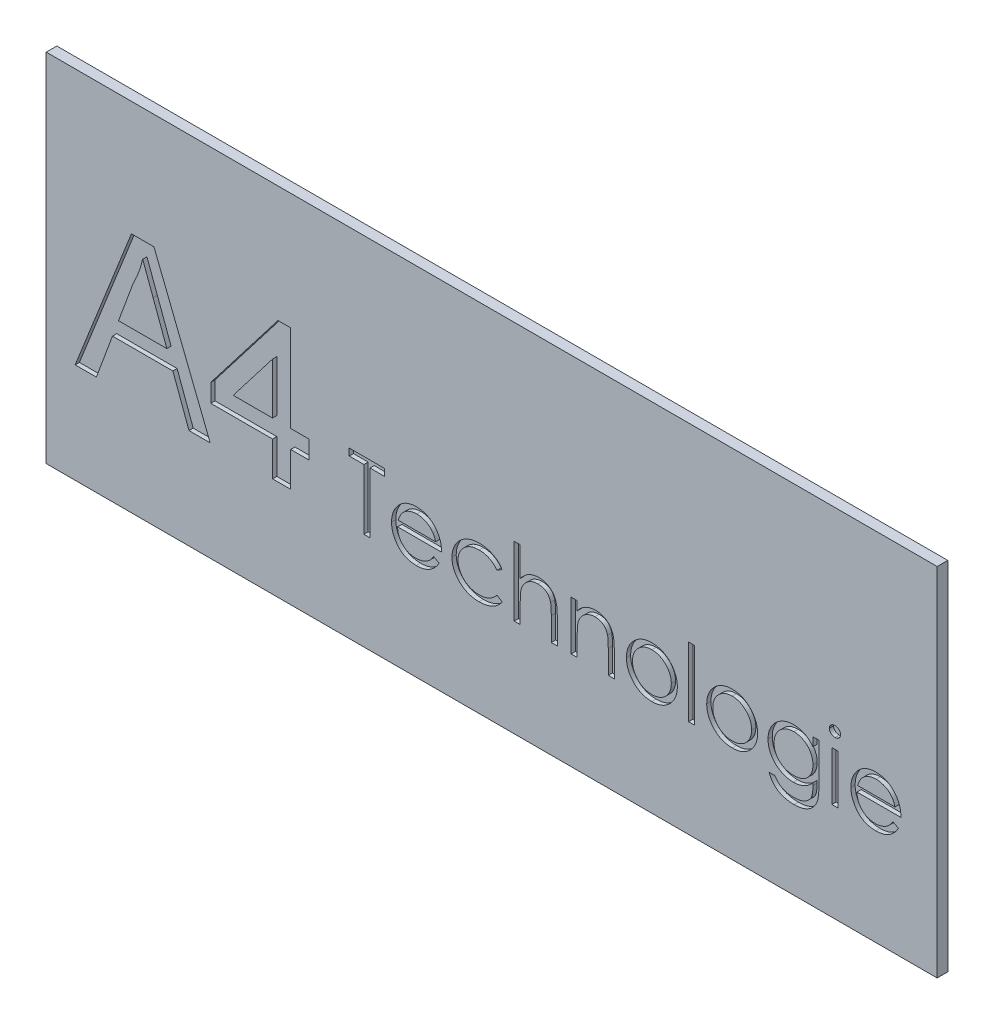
from build123d import *

# Parameters (mm, degrees)
ESQUISSE1_W             = 42
ESQUISSE1_H             = 16.8
EXTRUSION1_DEPTH        = 0.5
ENL_V_MAT_EXTRU_1_DEPTH = 0.2
ESQUISSE3_W             = 0.284935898
ESQUISSE3_H             = 3.256410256
ESQUISSE3_H_2           = 2.320192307
ENL_V_MAT_EXTRU_2_DEPTH = 0.2


with BuildPart() as part:
    # Esquisse1 → Extrusion1 (new body)
    with BuildSketch(Plane.XY):
        with Locations((21, 8.4)):
            Rectangle(ESQUISSE1_W, ESQUISSE1_H)
    extrude(amount=EXTRUSION1_DEPTH)

    # Esquisse2 → Enl_v. mat.-Extru.1 (cut)
    # profile 1 of 2: a face of its own
    with BuildSketch(Plane.XY.offset(0.5)):
        Polygon((1.364203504, 4.713201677), (4.01545748, 11.390830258), (5.077564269, 11.390830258), (7.728818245, 4.713201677), (6.729581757, 4.713201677), (5.969787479, 6.767856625), (3.12323427, 6.767856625), (2.363439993, 4.713201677), align=None)
        with BuildLine():
            Line((3.406819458, 7.538352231), (5.686202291, 7.538352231))
            Line((5.686202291, 7.538352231), (5.03743429, 9.293369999))
            add(Edge.make_bspline(
                [(5.03743429, 9.293369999), (5.012562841, 9.361181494), (4.963934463, 9.49376577), (4.891414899, 9.686399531), (4.825162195, 9.869332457), (4.760195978, 10.039941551), (4.701549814, 10.200705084), (4.647494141, 10.350537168), (4.594033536, 10.488396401), (4.561951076, 10.57746767), (4.546510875, 10.620334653)],
                knots=[0, 0, 0, 0, 1.225184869, 2.395467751, 3.491410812, 4.525364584, 5.492066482, 6.394148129, 7.227157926, 8, 8, 8, 8], degree=3))
            add(Edge.make_bspline(
                [(4.546510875, 10.620334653), (4.520969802, 10.514628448), (4.469782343, 10.30278018), (4.362608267, 9.992394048), (4.240004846, 9.684846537), (4.140436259, 9.48666502), (4.090366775, 9.387006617)],
                knots=[0, 0, 0, 0, 0.9891762, 1.982431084, 2.985436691, 4, 4, 4, 4], degree=3))
            Line((4.090366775, 9.387006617), (3.406819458, 7.538352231))
        make_face(mode=Mode.SUBTRACT)
    # profile 2 of 2: a face of its own
    with BuildSketch(Plane.XY.offset(0.5)):
        Polygon((10.667670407, 4.713201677), (10.667670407, 6.339803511), (7.756909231, 6.339803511), (7.756909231, 7.195909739), (10.924502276, 11.305219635), (11.523776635, 11.305219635), (11.523776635, 7.195909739), (12.379882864, 7.195909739), (12.379882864, 6.339803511), (11.523776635, 6.339803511), (11.523776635, 4.713201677), align=None)
        Polygon((10.667670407, 7.195909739), (10.667670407, 9.601033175), (8.813665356, 7.195909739), align=None, mode=Mode.SUBTRACT)
    extrude(amount=-ENL_V_MAT_EXTRU_1_DEPTH, mode=Mode.SUBTRACT)

    # Esquisse3 → Enl_v. mat.-Extru.2 (cut)
    # profile 1 of 12: a face of its own
    with BuildSketch(Plane.XY.offset(0.5)):
        Polygon((14.28392338, 7.45181383), (14.28392338, 7.777454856), (15.952833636, 7.777454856), (15.952833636, 7.45181383), (15.260846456, 7.45181383), (15.260846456, 4.602454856), (14.975910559, 4.602454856), (14.975910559, 7.45181383), align=None)
    # profile 2 of 12: a face of its own
    with BuildSketch(Plane.XY.offset(0.5)):
        with BuildLine():
            Line((18.264121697, 5.335147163), (18.517256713, 5.202219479))
            add(Edge.make_bspline(
                [(18.517256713, 5.202219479), (18.497084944, 5.166438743), (18.457838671, 5.0968236), (18.390346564, 5.00118184), (18.319596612, 4.915141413), (18.242395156, 4.84100094), (18.161051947, 4.776365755), (18.075115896, 4.719816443), (17.984139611, 4.671630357), (17.888118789, 4.631033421), (17.786247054, 4.599819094), (17.678277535, 4.577771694), (17.564003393, 4.564143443), (17.485675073, 4.562560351), (17.445567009, 4.561749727)],
                knots=[0, 0, 0, 0, 1.120438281, 2.179929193, 3.190490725, 4.156257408, 5.095198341, 6.022838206, 6.959905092, 7.901321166, 8.864066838, 9.862729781, 10.905609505, 12, 12, 12, 12], degree=3))
            add(Edge.make_bspline(
                [(17.445567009, 4.561749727), (17.400988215, 4.562790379), (17.314027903, 4.56482039), (17.187445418, 4.582321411), (17.068265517, 4.610871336), (16.956494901, 4.650754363), (16.852407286, 4.70284915), (16.755795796, 4.766312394), (16.666152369, 4.840818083), (16.586301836, 4.927011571), (16.514416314, 5.019251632), (16.450983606, 5.115368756), (16.397954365, 5.215121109), (16.354817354, 5.317873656), (16.319978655, 5.42297876), (16.295697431, 5.531392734), (16.281700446, 5.642822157), (16.279555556, 5.718203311), (16.278474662, 5.756190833)],
                knots=[0, 0, 0, 0, 1.145258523, 2.234067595, 3.276747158, 4.290159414, 5.277019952, 6.260822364, 7.254936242, 8.264827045, 9.274100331, 10.257902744, 11.220704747, 12.172965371, 13.118907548, 14.062713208, 15.023725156, 16, 16, 16, 16], degree=3))
            add(Edge.make_bspline(
                [(16.278474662, 5.756190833), (16.279435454, 5.791836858), (16.281339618, 5.862482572), (16.293341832, 5.967044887), (16.314612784, 6.068670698), (16.343801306, 6.167444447), (16.381494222, 6.263200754), (16.427606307, 6.355997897), (16.482209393, 6.445737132), (16.524366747, 6.502345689), (16.545602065, 6.530860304)],
                knots=[0, 0, 0, 0, 1.024358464, 2.0301432, 3.019427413, 4.004406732, 4.986367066, 5.972626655, 6.978780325, 8, 8, 8, 8], degree=3))
            add(Edge.make_bspline(
                [(16.545602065, 6.530860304), (16.574365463, 6.565212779), (16.630981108, 6.63282953), (16.726735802, 6.721673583), (16.830422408, 6.796099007), (16.940741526, 6.857791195), (17.058975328, 6.904666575), (17.18353447, 6.939598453), (17.315837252, 6.959172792), (17.406284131, 6.961937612), (17.452563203, 6.963352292)],
                knots=[0, 0, 0, 0, 1.030682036, 2.02871468, 2.997146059, 3.962720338, 4.930598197, 5.918074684, 6.934738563, 8, 8, 8, 8], degree=3))
            add(Edge.make_bspline(
                [(17.452563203, 6.963352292), (17.500140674, 6.962123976), (17.593476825, 6.9597143), (17.729577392, 6.937374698), (17.858356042, 6.901948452), (17.979761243, 6.851916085), (18.093805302, 6.787364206), (18.199746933, 6.707406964), (18.299397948, 6.614499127), (18.357372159, 6.543049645), (18.386873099, 6.506691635)],
                knots=[0, 0, 0, 0, 1.056321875, 2.072262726, 3.055038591, 4.01806755, 4.982017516, 5.957941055, 6.960871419, 8, 8, 8, 8], degree=3))
            add(Edge.make_bspline(
                [(18.386873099, 6.506691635), (18.406945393, 6.479292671), (18.446956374, 6.424677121), (18.497073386, 6.335621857), (18.540577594, 6.242448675), (18.575351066, 6.143651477), (18.603508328, 6.040400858), (18.623879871, 5.931958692), (18.635826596, 5.818357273), (18.638174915, 5.740953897), (18.639372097, 5.701493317)],
                knots=[0, 0, 0, 0, 0.94817472, 1.890038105, 2.849395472, 3.817997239, 4.812318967, 5.836947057, 6.897266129, 8, 8, 8, 8], degree=3))
            Line((18.639372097, 5.701493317), (16.563410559, 5.701493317))
            add(Edge.make_bspline(
                [(16.563410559, 5.701493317), (16.564807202, 5.670922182), (16.567553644, 5.610805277), (16.580358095, 5.522838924), (16.600540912, 5.439043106), (16.628906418, 5.360046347), (16.663257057, 5.284816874), (16.705335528, 5.21391274), (16.755536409, 5.147656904), (16.811530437, 5.085456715), (16.873857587, 5.030065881), (16.939428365, 4.980488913), (17.009181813, 4.938936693), (17.082567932, 4.905209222), (17.159468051, 4.878805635), (17.2399064, 4.860782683), (17.323724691, 4.848711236), (17.38086175, 4.847368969), (17.409950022, 4.846685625)],
                knots=[0, 0, 0, 0, 1.094153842, 2.151609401, 3.174256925, 4.172055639, 5.149267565, 6.128595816, 7.11444997, 8.118368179, 9.117203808, 10.09244225, 11.054858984, 12.015122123, 12.976791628, 13.957293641, 14.960065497, 16, 16, 16, 16], degree=3))
            add(Edge.make_bspline(
                [(17.409950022, 4.846685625), (17.438389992, 4.847237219), (17.494820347, 4.848331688), (17.578858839, 4.858974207), (17.66153541, 4.876182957), (17.742507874, 4.899668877), (17.820132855, 4.928313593), (17.89201989, 4.962878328), (17.958132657, 5.001114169), (18.019924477, 5.044847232), (18.079860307, 5.098376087), (18.139316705, 5.165174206), (18.203067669, 5.244175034), (18.242972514, 5.303634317), (18.264121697, 5.335147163)],
                knots=[0, 0, 0, 0, 0.99110716, 1.966546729, 2.947904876, 3.932708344, 4.903319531, 5.828989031, 6.710028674, 7.56322171, 8.463672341, 9.504779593, 10.677557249, 12, 12, 12, 12], degree=3))
        make_face()
        with BuildLine():
            add(Edge.make_bspline(
                [(18.3544362, 5.986429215), (18.344007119, 6.024223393), (18.323934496, 6.09696502), (18.281991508, 6.197694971), (18.234755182, 6.287218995), (18.178855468, 6.364851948), (18.11551991, 6.433797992), (18.042363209, 6.494049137), (17.960324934, 6.547949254), (17.869829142, 6.593444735), (17.773996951, 6.632170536), (17.673661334, 6.658137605), (17.571283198, 6.675926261), (17.502037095, 6.677582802), (17.467191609, 6.678416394)],
                knots=[0, 0, 0, 0, 1.154881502, 2.222775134, 3.210006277, 4.132804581, 5.035138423, 5.962687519, 6.919655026, 7.923214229, 8.944639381, 9.960483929, 10.97369054, 12, 12, 12, 12], degree=3))
            add(Edge.make_bspline(
                [(17.467191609, 6.678416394), (17.438753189, 6.677861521), (17.382536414, 6.676764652), (17.299713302, 6.666359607), (17.220175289, 6.649160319), (17.143335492, 6.625606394), (17.070200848, 6.594211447), (16.999267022, 6.557396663), (16.932337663, 6.512455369), (16.890480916, 6.478202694), (16.869335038, 6.460898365)],
                knots=[0, 0, 0, 0, 1.04873581, 2.073130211, 3.073294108, 4.04793562, 5.032784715, 6.005352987, 6.992311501, 8, 8, 8, 8], degree=3))
            add(Edge.make_bspline(
                [(16.869335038, 6.460898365), (16.854191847, 6.447205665), (16.823545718, 6.419494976), (16.782596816, 6.371752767), (16.743389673, 6.320270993), (16.707708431, 6.263080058), (16.674980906, 6.200831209), (16.644355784, 6.134049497), (16.616790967, 6.062228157), (16.601282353, 6.012178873), (16.593303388, 5.986429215)],
                knots=[0, 0, 0, 0, 0.879870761, 1.780643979, 2.707998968, 3.669668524, 4.684282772, 5.740141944, 6.837334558, 8, 8, 8, 8], degree=3))
            Line((16.593303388, 5.986429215), (18.3544362, 5.986429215))
        make_face(mode=Mode.SUBTRACT)
    # profile 3 of 12: a face of its own
    with BuildSketch(Plane.XY.offset(0.5)):
        with BuildLine():
            Line((21.488731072, 6.419557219), (21.250224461, 6.271365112))
            add(Edge.make_bspline(
                [(21.250224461, 6.271365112), (21.224071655, 6.303866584), (21.172594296, 6.367840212), (21.083205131, 6.450399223), (20.987944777, 6.521307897), (20.885185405, 6.579096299), (20.775071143, 6.623747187), (20.658036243, 6.655343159), (20.534097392, 6.675032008), (20.449129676, 6.677269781), (20.405593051, 6.678416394)],
                knots=[0, 0, 0, 0, 1.026593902, 2.0206758, 2.988051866, 3.946915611, 4.916868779, 5.907761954, 6.927957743, 8, 8, 8, 8], degree=3))
            add(Edge.make_bspline(
                [(20.405593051, 6.678416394), (20.370795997, 6.677457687), (20.302264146, 6.67556954), (20.201656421, 6.663767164), (20.105823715, 6.642320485), (20.014165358, 6.614062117), (19.927333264, 6.57618864), (19.845099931, 6.530096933), (19.76673595, 6.47653011), (19.694512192, 6.414471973), (19.628445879, 6.346981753), (19.571206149, 6.274633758), (19.521370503, 6.199594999), (19.482267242, 6.119991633), (19.450267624, 6.037644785), (19.429215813, 5.951000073), (19.415187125, 5.861167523), (19.413582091, 5.799918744), (19.412769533, 5.768911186)],
                knots=[0, 0, 0, 0, 1.112346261, 2.190735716, 3.231507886, 4.247384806, 5.251966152, 6.253067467, 7.256802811, 8.280671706, 9.291813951, 10.270744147, 11.225547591, 12.165006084, 13.100104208, 14.043489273, 15.009504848, 16, 16, 16, 16], degree=3))
            add(Edge.make_bspline(
                [(19.412769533, 5.768911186), (19.414383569, 5.728299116), (19.417589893, 5.647622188), (19.442719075, 5.528534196), (19.48385293, 5.413396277), (19.540148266, 5.303025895), (19.611338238, 5.200886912), (19.69495192, 5.109280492), (19.79103566, 5.029981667), (19.898742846, 4.964238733), (20.015544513, 4.91138735), (20.140176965, 4.873734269), (20.271621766, 4.851008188), (20.361616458, 4.848145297), (20.407501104, 4.846685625)],
                knots=[0, 0, 0, 0, 0.966302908, 1.919585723, 2.883856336, 3.870342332, 4.860282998, 5.839159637, 6.814385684, 7.815993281, 8.834850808, 9.858348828, 10.908058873, 12, 12, 12, 12], degree=3))
            add(Edge.make_bspline(
                [(20.407501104, 4.846685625), (20.449551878, 4.847864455), (20.532192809, 4.850181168), (20.65299456, 4.869711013), (20.768002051, 4.901682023), (20.877211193, 4.946265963), (20.980422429, 5.003894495), (21.076968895, 5.074977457), (21.168771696, 5.157469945), (21.222743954, 5.22125839), (21.250224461, 5.253736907)],
                knots=[0, 0, 0, 0, 1.039848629, 2.043578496, 3.018386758, 3.987534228, 4.954977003, 5.934852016, 6.948509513, 8, 8, 8, 8], degree=3))
            Line((21.250224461, 5.253736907), (21.488731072, 5.09727657))
            add(Edge.make_bspline(
                [(21.488731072, 5.09727657), (21.474590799, 5.076511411), (21.446357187, 5.035050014), (21.399160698, 4.976589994), (21.348251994, 4.921869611), (21.293829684, 4.870962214), (21.236604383, 4.822649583), (21.174621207, 4.779241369), (21.109878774, 4.738297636), (21.041617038, 4.70145596), (20.970541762, 4.668339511), (20.896752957, 4.639863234), (20.82057127, 4.615397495), (20.741907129, 4.595950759), (20.66060545, 4.580428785), (20.576876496, 4.570129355), (20.490749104, 4.562441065), (20.432535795, 4.561982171), (20.40304898, 4.561749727)],
                knots=[0, 0, 0, 0, 0.954134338, 1.905101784, 2.851144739, 3.791306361, 4.734911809, 5.6936923, 6.663572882, 7.643865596, 8.638447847, 9.640600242, 10.646758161, 11.676244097, 12.717260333, 13.78922464, 14.880174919, 16, 16, 16, 16], degree=3))
            add(Edge.make_bspline(
                [(20.40304898, 4.561749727), (20.358044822, 4.562558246), (20.269836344, 4.564142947), (20.140729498, 4.581567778), (20.017345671, 4.607836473), (19.899727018, 4.645540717), (19.787855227, 4.694077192), (19.681834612, 4.75336525), (19.582016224, 4.823897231), (19.489387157, 4.904417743), (19.404313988, 4.991721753), (19.33126523, 5.085928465), (19.267905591, 5.183574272), (19.217026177, 5.286815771), (19.176525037, 5.394280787), (19.148852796, 5.506830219), (19.130955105, 5.623536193), (19.128883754, 5.70312245), (19.127833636, 5.743470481)],
                knots=[0, 0, 0, 0, 1.1129367, 2.181364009, 3.217532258, 4.231199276, 5.232079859, 6.230262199, 7.231623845, 8.250719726, 9.263571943, 10.242672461, 11.195837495, 12.138959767, 13.085126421, 14.0317438, 15.002148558, 16, 16, 16, 16], degree=3))
            add(Edge.make_bspline(
                [(19.127833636, 5.743470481), (19.128233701, 5.770846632), (19.129029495, 5.825302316), (19.138157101, 5.906124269), (19.149948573, 5.985869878), (19.169929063, 6.063528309), (19.19300735, 6.140277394), (19.222467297, 6.215192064), (19.257025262, 6.288620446), (19.296260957, 6.360373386), (19.340428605, 6.429270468), (19.389306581, 6.494361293), (19.441053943, 6.556427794), (19.498091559, 6.613327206), (19.557998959, 6.667335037), (19.622471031, 6.717008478), (19.691137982, 6.76249352), (19.762968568, 6.804631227), (19.837920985, 6.842150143), (19.915542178, 6.87447458), (19.995364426, 6.902099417), (20.077515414, 6.92396965), (20.161449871, 6.942309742), (20.247829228, 6.953846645), (20.33632303, 6.961998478), (20.396245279, 6.962897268), (20.426581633, 6.963352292)],
                knots=[0, 0, 0, 0, 0.990994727, 1.971252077, 2.943264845, 3.907940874, 4.872158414, 5.844625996, 6.82015047, 7.809835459, 8.804511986, 9.781214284, 10.756496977, 11.728388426, 12.696359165, 13.676225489, 14.672885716, 15.677705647, 16.690706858, 17.706033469, 18.721040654, 19.747369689, 20.783475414, 21.830280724, 22.901553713, 24, 24, 24, 24], degree=3))
            add(Edge.make_bspline(
                [(20.426581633, 6.963352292), (20.464572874, 6.962516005), (20.540365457, 6.960847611), (20.652797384, 6.946806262), (20.76357331, 6.925636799), (20.870749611, 6.894274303), (20.973026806, 6.856297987), (21.068762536, 6.813650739), (21.155703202, 6.764125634), (21.235466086, 6.709950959), (21.308200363, 6.648844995), (21.374652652, 6.580077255), (21.436185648, 6.504005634), (21.471071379, 6.447939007), (21.488731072, 6.419557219)],
                knots=[0, 0, 0, 0, 1.095225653, 2.184976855, 3.262915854, 4.344593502, 5.400796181, 6.407717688, 7.363229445, 8.282371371, 9.184954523, 10.097238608, 11.036792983, 12, 12, 12, 12], degree=3))
        make_face()
    # profile 4 of 12: a face of its own
    with BuildSketch(Plane.XY.offset(0.5)):
        with BuildLine():
            Line((22.058602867, 7.858865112), (22.343538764, 7.858865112))
            Line((22.343538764, 7.858865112), (22.343538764, 6.484431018))
            add(Edge.make_bspline(
                [(22.343538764, 6.484431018), (22.374125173, 6.52266163), (22.43367848, 6.597098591), (22.533914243, 6.694218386), (22.636848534, 6.778399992), (22.746036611, 6.84541105), (22.859475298, 6.898348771), (22.977643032, 6.935893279), (23.10056177, 6.958981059), (23.184041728, 6.961882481), (23.226331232, 6.963352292)],
                knots=[0, 0, 0, 0, 1.125788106, 2.19196713, 3.20547328, 4.180437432, 5.132270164, 6.079753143, 7.027236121, 8, 8, 8, 8], degree=3))
            add(Edge.make_bspline(
                [(23.226331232, 6.963352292), (23.26926666, 6.961768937), (23.353301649, 6.95866993), (23.475658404, 6.934164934), (23.589922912, 6.892293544), (23.695755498, 6.834992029), (23.790846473, 6.763624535), (23.875074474, 6.681227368), (23.943872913, 6.585728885), (23.990680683, 6.497503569), (24.02113656, 6.419000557), (24.040415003, 6.351657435), (24.05676099, 6.276616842), (24.071002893, 6.193917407), (24.080494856, 6.103162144), (24.088119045, 6.004760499), (24.093540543, 5.898718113), (24.093750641, 5.825311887), (24.093859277, 5.787355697)],
                knots=[0, 0, 0, 0, 1.235656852, 2.418478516, 3.575258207, 4.727955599, 5.870717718, 6.98870536, 8.107142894, 9.245821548, 9.854588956, 10.528768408, 11.260415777, 12.065282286, 12.943670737, 13.886611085, 14.907229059, 16, 16, 16, 16], degree=3))
            Line((24.093859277, 5.787355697), (24.093859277, 4.602454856))
            Line((24.093859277, 4.602454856), (23.80892338, 4.602454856))
            Line((23.80892338, 4.602454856), (23.80892338, 5.693861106))
            add(Edge.make_bspline(
                [(23.80892338, 5.693861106), (23.808750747, 5.725450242), (23.808420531, 5.785874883), (23.807328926, 5.872385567), (23.804892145, 5.950849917), (23.800954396, 6.021016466), (23.79681301, 6.082983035), (23.791113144, 6.136659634), (23.784481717, 6.182119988), (23.778522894, 6.209483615), (23.775850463, 6.221755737)],
                knots=[0, 0, 0, 0, 1.430932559, 2.737130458, 3.918967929, 4.986496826, 5.920444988, 6.731744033, 7.431208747, 8, 8, 8, 8], degree=3))
            add(Edge.make_bspline(
                [(23.775850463, 6.221755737), (23.765487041, 6.257764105), (23.745563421, 6.326989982), (23.699255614, 6.421026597), (23.641417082, 6.501204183), (23.570798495, 6.566440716), (23.488649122, 6.617614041), (23.394433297, 6.653054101), (23.289037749, 6.675050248), (23.214786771, 6.677263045), (23.176085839, 6.678416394)],
                knots=[0, 0, 0, 0, 1.090059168, 2.095632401, 3.037101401, 3.955032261, 4.878929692, 5.839099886, 6.873700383, 8, 8, 8, 8], degree=3))
            add(Edge.make_bspline(
                [(23.176085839, 6.678416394), (23.15316436, 6.677984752), (23.107803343, 6.677130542), (23.04053991, 6.668554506), (22.975289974, 6.654540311), (22.911425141, 6.635576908), (22.850298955, 6.609772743), (22.790129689, 6.579900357), (22.732622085, 6.543335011), (22.676754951, 6.502308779), (22.62475976, 6.456888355), (22.576384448, 6.408948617), (22.533260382, 6.357899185), (22.494191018, 6.30455908), (22.460465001, 6.248196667), (22.43102542, 6.189355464), (22.40604661, 6.127958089), (22.393634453, 6.085344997), (22.38742398, 6.064023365)],
                knots=[0, 0, 0, 0, 1.024319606, 2.027102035, 3.025350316, 4.005802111, 5.00026367, 5.987881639, 7.005602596, 8.042517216, 9.083927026, 10.089214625, 11.084353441, 12.06828073, 13.041928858, 14.016821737, 15.00770877, 16, 16, 16, 16], degree=3))
            add(Edge.make_bspline(
                [(22.38742398, 6.064023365), (22.383850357, 6.048582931), (22.376062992, 6.014936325), (22.367613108, 5.959442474), (22.360049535, 5.894956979), (22.353655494, 5.821577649), (22.349733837, 5.739035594), (22.345508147, 5.647894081), (22.343935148, 5.547582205), (22.343674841, 5.477826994), (22.343538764, 5.441362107)],
                knots=[0, 0, 0, 0, 0.607992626, 1.324890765, 2.152360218, 3.099583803, 4.150613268, 5.323148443, 6.60066238, 8, 8, 8, 8], degree=3))
            Line((22.343538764, 5.441362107), (22.343538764, 4.602454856))
            Line((22.343538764, 4.602454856), (22.058602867, 4.602454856))
            Line((22.058602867, 4.602454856), (22.058602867, 7.858865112))
        make_face()
    # profile 5 of 12: a face of its own
    with BuildSketch(Plane.XY.offset(0.5)):
        with BuildLine():
            Line((24.745141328, 6.922647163), (25.030077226, 6.922647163))
            Line((25.030077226, 6.922647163), (25.030077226, 6.504147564))
            add(Edge.make_bspline(
                [(25.030077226, 6.504147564), (25.060500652, 6.542104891), (25.119538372, 6.615762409), (25.217858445, 6.712573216), (25.321766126, 6.792352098), (25.430625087, 6.855946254), (25.544583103, 6.903885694), (25.662945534, 6.938507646), (25.786421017, 6.959267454), (25.870390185, 6.96198002), (25.912869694, 6.963352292)],
                knots=[0, 0, 0, 0, 1.12780773, 2.188550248, 3.19190651, 4.159438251, 5.104880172, 6.052711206, 7.014878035, 8, 8, 8, 8], degree=3))
            add(Edge.make_bspline(
                [(25.912869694, 6.963352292), (25.95580534, 6.96176915), (26.039840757, 6.95867056), (26.162194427, 6.934162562), (26.276470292, 6.892302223), (26.382260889, 6.834959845), (26.477626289, 6.763652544), (26.561378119, 6.680578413), (26.630650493, 6.585023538), (26.677093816, 6.496374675), (26.707687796, 6.417735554), (26.726948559, 6.350383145), (26.743305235, 6.275345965), (26.757485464, 6.192850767), (26.767080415, 6.102319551), (26.774648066, 6.004123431), (26.780071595, 5.898294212), (26.780286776, 5.825099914), (26.780397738, 5.787355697)],
                knots=[0, 0, 0, 0, 1.235846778, 2.418850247, 3.575807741, 4.728682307, 5.871620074, 6.994088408, 8.11269785, 9.256955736, 9.865816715, 10.540099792, 11.271859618, 12.076849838, 12.949306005, 13.892391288, 14.913166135, 16, 16, 16, 16], degree=3))
            Line((26.780397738, 5.787355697), (26.780397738, 4.602454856))
            Line((26.780397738, 4.602454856), (26.495461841, 4.602454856))
            Line((26.495461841, 4.602454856), (26.495461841, 5.693861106))
            add(Edge.make_bspline(
                [(26.495461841, 5.693861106), (26.495286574, 5.725450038), (26.494951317, 5.785874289), (26.493893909, 5.872387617), (26.491345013, 5.950843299), (26.487763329, 6.021053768), (26.482520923, 6.082951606), (26.477057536, 6.136662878), (26.47037645, 6.182119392), (26.46442295, 6.209483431), (26.461752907, 6.221755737)],
                knots=[0, 0, 0, 0, 1.430800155, 2.736877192, 3.918605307, 4.986035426, 5.920637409, 6.731861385, 7.431261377, 8, 8, 8, 8], degree=3))
            add(Edge.make_bspline(
                [(26.461752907, 6.221755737), (26.452114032, 6.257779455), (26.43356218, 6.327113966), (26.387720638, 6.421161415), (26.329832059, 6.501169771), (26.259167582, 6.566644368), (26.176409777, 6.617599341), (26.081788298, 6.652954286), (25.976216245, 6.675067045), (25.901962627, 6.6772688), (25.863260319, 6.678416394)],
                knots=[0, 0, 0, 0, 1.084156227, 2.086665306, 3.027808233, 3.945421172, 4.874247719, 5.839848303, 6.874090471, 8, 8, 8, 8], degree=3))
            add(Edge.make_bspline(
                [(25.863260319, 6.678416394), (25.84033892, 6.67798459), (25.794978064, 6.677130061), (25.727713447, 6.668556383), (25.662467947, 6.654533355), (25.598586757, 6.63560252), (25.537347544, 6.609601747), (25.476782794, 6.580092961), (25.419173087, 6.54330994), (25.363290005, 6.502315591), (25.311299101, 6.456886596), (25.26292268, 6.408949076), (25.219798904, 6.357899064), (25.180729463, 6.304559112), (25.147003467, 6.248196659), (25.11756388, 6.189355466), (25.092585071, 6.127958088), (25.080172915, 6.085344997), (25.073962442, 6.064023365)],
                knots=[0, 0, 0, 0, 1.023777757, 2.026029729, 3.023749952, 4.003683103, 4.997618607, 5.993177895, 7.010360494, 8.046726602, 9.087585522, 10.09234134, 11.086953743, 12.070360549, 13.043493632, 14.017870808, 15.008233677, 16, 16, 16, 16], degree=3))
            add(Edge.make_bspline(
                [(25.073962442, 6.064023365), (25.070388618, 6.048370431), (25.06260859, 6.014294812), (25.054205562, 5.958374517), (25.046578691, 5.893686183), (25.040195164, 5.820305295), (25.036289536, 5.737974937), (25.032031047, 5.647046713), (25.030480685, 5.547158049), (25.030215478, 5.477614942), (25.030077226, 5.441362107)],
                knots=[0, 0, 0, 0, 0.615963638, 1.340920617, 2.168419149, 3.115676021, 4.16674242, 5.331190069, 6.6087489, 8, 8, 8, 8], degree=3))
            Line((25.030077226, 5.441362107), (25.030077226, 4.602454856))
            Line((25.030077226, 4.602454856), (24.745141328, 4.602454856))
            Line((24.745141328, 4.602454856), (24.745141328, 6.922647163))
        make_face()
    # profile 6 of 12: a face of its own
    with BuildSketch(Plane.XY.offset(0.5)):
        with BuildLine():
            add(Edge.make_bspline(
                [(28.552342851, 6.963352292), (28.595877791, 6.96242529), (28.68123917, 6.960607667), (28.806250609, 6.941181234), (28.925580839, 6.911474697), (29.039686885, 6.870406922), (29.147107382, 6.815359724), (29.24940701, 6.749674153), (29.346305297, 6.671857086), (29.404383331, 6.611660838), (29.433863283, 6.581105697)],
                knots=[0, 0, 0, 0, 1.054011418, 2.066658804, 3.057071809, 4.030435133, 4.997543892, 5.974964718, 6.972108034, 8, 8, 8, 8], degree=3))
            add(Edge.make_bspline(
                [(29.433863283, 6.581105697), (29.459246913, 6.55188301), (29.509522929, 6.494003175), (29.573989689, 6.400154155), (29.62952639, 6.302962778), (29.674033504, 6.201138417), (29.709126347, 6.095569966), (29.734041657, 5.98589457), (29.748861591, 5.872354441), (29.750859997, 5.795243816), (29.751872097, 5.756190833)],
                knots=[0, 0, 0, 0, 1.025258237, 2.030674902, 3.01204498, 3.988269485, 4.97094183, 5.956517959, 6.965070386, 8, 8, 8, 8], degree=3))
            add(Edge.make_bspline(
                [(29.751872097, 5.756190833), (29.750981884, 5.716911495), (29.749222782, 5.639293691), (29.732582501, 5.524976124), (29.70670073, 5.414127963), (29.66966042, 5.307213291), (29.622164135, 5.203905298), (29.564206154, 5.104655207), (29.495379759, 5.0092672), (29.417361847, 4.918551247), (29.331136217, 4.834943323), (29.237595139, 4.762074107), (29.138576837, 4.699643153), (29.032764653, 4.649354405), (28.921124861, 4.609703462), (28.803416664, 4.581854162), (28.679822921, 4.565016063), (28.595433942, 4.562853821), (28.552342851, 4.561749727)],
                knots=[0, 0, 0, 0, 0.998656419, 1.973391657, 2.932242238, 3.890759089, 4.846373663, 5.82037756, 6.809684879, 7.83454468, 8.860553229, 9.859544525, 10.845671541, 11.83227036, 12.833544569, 13.85385346, 14.904124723, 16, 16, 16, 16], degree=3))
            add(Edge.make_bspline(
                [(28.552342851, 4.561749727), (28.509040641, 4.562857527), (28.424231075, 4.565027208), (28.300201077, 4.581788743), (28.182281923, 4.609690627), (28.07049598, 4.64948471), (27.964228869, 4.69964476), (27.864636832, 4.761885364), (27.771019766, 4.834964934), (27.684775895, 4.918545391), (27.606762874, 5.009268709), (27.537935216, 5.104654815), (27.479977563, 5.2039054), (27.432481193, 5.307213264), (27.395440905, 5.414127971), (27.369559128, 5.524976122), (27.35291885, 5.639293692), (27.351159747, 5.716911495), (27.350269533, 5.756190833)],
                knots=[0, 0, 0, 0, 1.099876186, 2.154163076, 3.173186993, 4.173200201, 5.163417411, 6.152872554, 7.150605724, 8.17532212, 9.198891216, 10.186952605, 11.159729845, 12.11414092, 13.071450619, 14.029093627, 15.002601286, 16, 16, 16, 16], degree=3))
            add(Edge.make_bspline(
                [(27.350269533, 5.756190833), (27.351288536, 5.795031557), (27.353305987, 5.871929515), (27.36811102, 5.985256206), (27.392929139, 6.09474598), (27.428064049, 6.199906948), (27.472981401, 6.301285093), (27.527737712, 6.398716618), (27.592862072, 6.492141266), (27.642938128, 6.549946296), (27.668278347, 6.579197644)],
                knots=[0, 0, 0, 0, 1.031353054, 2.041901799, 3.029428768, 4.008703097, 4.981709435, 5.96992636, 6.972712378, 8, 8, 8, 8], degree=3))
            add(Edge.make_bspline(
                [(27.668278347, 6.579197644), (27.697713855, 6.610017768), (27.75560396, 6.670630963), (27.852984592, 6.748221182), (27.955032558, 6.81527362), (28.06364017, 6.869227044), (28.177652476, 6.911716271), (28.297594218, 6.941257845), (28.423029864, 6.960537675), (28.508808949, 6.962404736), (28.552342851, 6.963352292)],
                knots=[0, 0, 0, 0, 1.027980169, 2.021703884, 2.998553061, 3.971491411, 4.943284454, 5.930300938, 6.949603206, 8, 8, 8, 8], degree=3))
        make_face()
        with BuildLine():
            add(Edge.make_bspline(
                [(28.551070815, 6.678416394), (28.520284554, 6.677541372), (28.459506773, 6.675813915), (28.370044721, 6.662674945), (28.283920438, 6.64185828), (28.20097053, 6.612281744), (28.121474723, 6.574092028), (28.045356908, 6.527185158), (27.972393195, 6.472182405), (27.904010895, 6.409169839), (27.841252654, 6.340336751), (27.78639049, 6.26699574), (27.739740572, 6.190336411), (27.700878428, 6.110279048), (27.67193405, 6.026012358), (27.650912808, 5.938490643), (27.637786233, 5.847535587), (27.636075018, 5.785703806), (27.635205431, 5.75428278)],
                knots=[0, 0, 0, 0, 1.021534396, 2.016698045, 2.994645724, 3.958388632, 4.93408049, 5.916473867, 6.921342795, 7.962252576, 8.998418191, 10.008913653, 10.997312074, 11.973003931, 12.956656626, 13.948281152, 14.957379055, 16, 16, 16, 16], degree=3))
            add(Edge.make_bspline(
                [(27.635205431, 5.75428278), (27.636663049, 5.713686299), (27.63955615, 5.633109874), (27.663083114, 5.514445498), (27.702440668, 5.400524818), (27.7555877, 5.292015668), (27.822177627, 5.191620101), (27.900633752, 5.102110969), (27.990114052, 5.024835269), (28.089551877, 4.960717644), (28.196916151, 4.909772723), (28.310541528, 4.873669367), (28.4290513, 4.850200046), (28.510041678, 4.847867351), (28.551070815, 4.846685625)],
                knots=[0, 0, 0, 0, 1.016792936, 2.018143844, 3.017858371, 4.030088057, 5.03801393, 6.028138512, 7.003788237, 7.991172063, 8.984598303, 9.972568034, 10.972917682, 12, 12, 12, 12], degree=3))
            add(Edge.make_bspline(
                [(28.551070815, 4.846685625), (28.592097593, 4.847874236), (28.673083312, 4.850220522), (28.791428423, 4.873551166), (28.90474324, 4.909930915), (29.011995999, 4.960660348), (29.11138856, 5.025078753), (29.201512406, 5.10167461), (29.279298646, 5.191857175), (29.345822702, 5.292148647), (29.399840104, 5.400356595), (29.439013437, 5.514466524), (29.462596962, 5.633104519), (29.465482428, 5.713684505), (29.4669362, 5.75428278)],
                knots=[0, 0, 0, 0, 1.02726834, 2.027799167, 3.010890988, 4.004497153, 4.992059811, 5.971914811, 6.958719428, 7.966827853, 8.981595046, 9.981490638, 10.983022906, 12, 12, 12, 12], degree=3))
            add(Edge.make_bspline(
                [(29.4669362, 5.75428278), (29.466066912, 5.785703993), (29.464356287, 5.847536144), (29.451225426, 5.938488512), (29.430220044, 6.026020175), (29.401217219, 6.110250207), (29.362523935, 6.190543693), (29.314974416, 6.266770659), (29.260336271, 6.340590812), (29.19682074, 6.408947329), (29.128509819, 6.472206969), (29.055516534, 6.527206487), (28.979511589, 6.573885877), (28.900246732, 6.612608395), (28.817286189, 6.641589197), (28.731282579, 6.662795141), (28.64220223, 6.675758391), (28.581642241, 6.677524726), (28.551070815, 6.678416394)],
                knots=[0, 0, 0, 0, 1.042956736, 2.052379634, 3.044323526, 4.02829302, 5.004299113, 5.996692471, 7.007513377, 8.048758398, 9.090003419, 10.095195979, 11.07790575, 12.047570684, 13.018257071, 13.989683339, 14.985167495, 16, 16, 16, 16], degree=3))
        make_face(mode=Mode.SUBTRACT)
    # profile 7 of 12: a face of its own
    with BuildSketch(Plane.XY.offset(0.5)):
        with Locations((30.423506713, 6.230659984)):
            Rectangle(ESQUISSE3_W, ESQUISSE3_H)
    # profile 8 of 12: a face of its own
    with BuildSketch(Plane.XY.offset(0.5)):
        with BuildLine():
            add(Edge.make_bspline(
                [(32.337919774, 6.963352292), (32.381454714, 6.96242529), (32.466816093, 6.960607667), (32.591827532, 6.941181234), (32.711157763, 6.911474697), (32.825263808, 6.870406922), (32.932684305, 6.815359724), (33.034983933, 6.749674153), (33.13188222, 6.671857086), (33.189960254, 6.611660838), (33.219440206, 6.581105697)],
                knots=[0, 0, 0, 0, 1.054011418, 2.066658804, 3.057071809, 4.030435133, 4.997543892, 5.974964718, 6.972108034, 8, 8, 8, 8], degree=3))
            add(Edge.make_bspline(
                [(33.219440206, 6.581105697), (33.244823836, 6.55188301), (33.295099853, 6.494003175), (33.359566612, 6.400154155), (33.415103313, 6.302962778), (33.459610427, 6.201138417), (33.49470327, 6.095569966), (33.51961858, 5.98589457), (33.534438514, 5.872354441), (33.53643692, 5.795243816), (33.537449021, 5.756190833)],
                knots=[0, 0, 0, 0, 1.025258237, 2.030674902, 3.01204498, 3.988269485, 4.97094183, 5.956517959, 6.965070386, 8, 8, 8, 8], degree=3))
            add(Edge.make_bspline(
                [(33.537449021, 5.756190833), (33.536558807, 5.716911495), (33.534799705, 5.639293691), (33.518159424, 5.524976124), (33.492277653, 5.414127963), (33.455237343, 5.307213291), (33.407741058, 5.203905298), (33.349783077, 5.104655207), (33.280956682, 5.0092672), (33.20293877, 4.918551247), (33.11671314, 4.834943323), (33.023172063, 4.762074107), (32.924153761, 4.699643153), (32.818341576, 4.649354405), (32.706701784, 4.609703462), (32.588993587, 4.581854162), (32.465399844, 4.565016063), (32.381010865, 4.562853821), (32.337919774, 4.561749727)],
                knots=[0, 0, 0, 0, 0.998656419, 1.973391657, 2.932242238, 3.890759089, 4.846373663, 5.82037756, 6.809684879, 7.83454468, 8.860553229, 9.859544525, 10.845671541, 11.83227036, 12.833544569, 13.85385346, 14.904124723, 16, 16, 16, 16], degree=3))
            add(Edge.make_bspline(
                [(32.337919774, 4.561749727), (32.294617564, 4.562857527), (32.209807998, 4.565027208), (32.085778, 4.581788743), (31.967858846, 4.609690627), (31.856072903, 4.64948471), (31.749805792, 4.69964476), (31.650213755, 4.761885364), (31.556596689, 4.834964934), (31.470352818, 4.918545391), (31.392339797, 5.009268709), (31.32351214, 5.104654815), (31.265554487, 5.2039054), (31.218058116, 5.307213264), (31.181017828, 5.414127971), (31.155136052, 5.524976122), (31.138495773, 5.639293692), (31.13673667, 5.716911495), (31.135846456, 5.756190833)],
                knots=[0, 0, 0, 0, 1.099876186, 2.154163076, 3.173186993, 4.173200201, 5.163417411, 6.152872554, 7.150605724, 8.17532212, 9.198891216, 10.186952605, 11.159729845, 12.11414092, 13.071450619, 14.029093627, 15.002601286, 16, 16, 16, 16], degree=3))
            add(Edge.make_bspline(
                [(31.135846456, 5.756190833), (31.136865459, 5.795031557), (31.13888291, 5.871929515), (31.153687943, 5.985256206), (31.178506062, 6.09474598), (31.213640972, 6.199906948), (31.258558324, 6.301285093), (31.313314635, 6.398716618), (31.378438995, 6.492141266), (31.428515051, 6.549946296), (31.453855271, 6.579197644)],
                knots=[0, 0, 0, 0, 1.031353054, 2.041901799, 3.029428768, 4.008703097, 4.981709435, 5.96992636, 6.972712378, 8, 8, 8, 8], degree=3))
            add(Edge.make_bspline(
                [(31.453855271, 6.579197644), (31.483290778, 6.610017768), (31.541180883, 6.670630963), (31.638561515, 6.748221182), (31.740609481, 6.81527362), (31.849217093, 6.869227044), (31.963229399, 6.911716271), (32.083171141, 6.941257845), (32.208606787, 6.960537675), (32.294385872, 6.962404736), (32.337919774, 6.963352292)],
                knots=[0, 0, 0, 0, 1.027980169, 2.021703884, 2.998553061, 3.971491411, 4.943284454, 5.930300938, 6.949603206, 8, 8, 8, 8], degree=3))
        make_face()
        with BuildLine():
            add(Edge.make_bspline(
                [(32.336647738, 6.678416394), (32.305861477, 6.677541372), (32.245083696, 6.675813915), (32.155621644, 6.662674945), (32.069497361, 6.64185828), (31.986547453, 6.612281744), (31.907051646, 6.574092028), (31.830933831, 6.527185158), (31.757970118, 6.472182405), (31.689587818, 6.409169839), (31.626829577, 6.340336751), (31.571967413, 6.26699574), (31.525317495, 6.190336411), (31.486455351, 6.110279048), (31.457510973, 6.026012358), (31.436489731, 5.938490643), (31.423363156, 5.847535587), (31.421651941, 5.785703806), (31.420782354, 5.75428278)],
                knots=[0, 0, 0, 0, 1.021534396, 2.016698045, 2.994645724, 3.958388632, 4.93408049, 5.916473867, 6.921342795, 7.962252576, 8.998418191, 10.008913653, 10.997312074, 11.973003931, 12.956656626, 13.948281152, 14.957379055, 16, 16, 16, 16], degree=3))
            add(Edge.make_bspline(
                [(31.420782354, 5.75428278), (31.422239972, 5.713686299), (31.425133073, 5.633109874), (31.448660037, 5.514445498), (31.488017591, 5.400524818), (31.541164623, 5.292015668), (31.60775455, 5.191620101), (31.686210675, 5.102110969), (31.775690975, 5.024835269), (31.8751288, 4.960717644), (31.982493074, 4.909772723), (32.096118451, 4.873669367), (32.214628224, 4.850200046), (32.295618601, 4.847867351), (32.336647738, 4.846685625)],
                knots=[0, 0, 0, 0, 1.016792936, 2.018143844, 3.017858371, 4.030088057, 5.03801393, 6.028138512, 7.003788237, 7.991172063, 8.984598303, 9.972568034, 10.972917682, 12, 12, 12, 12], degree=3))
            add(Edge.make_bspline(
                [(32.336647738, 4.846685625), (32.377674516, 4.847874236), (32.458660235, 4.850220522), (32.577005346, 4.873551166), (32.690320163, 4.909930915), (32.797572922, 4.960660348), (32.896965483, 5.025078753), (32.987089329, 5.10167461), (33.064875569, 5.191857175), (33.131399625, 5.292148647), (33.185417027, 5.400356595), (33.22459036, 5.514466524), (33.248173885, 5.633104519), (33.251059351, 5.713684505), (33.252513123, 5.75428278)],
                knots=[0, 0, 0, 0, 1.02726834, 2.027799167, 3.010890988, 4.004497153, 4.992059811, 5.971914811, 6.958719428, 7.966827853, 8.981595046, 9.981490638, 10.983022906, 12, 12, 12, 12], degree=3))
            add(Edge.make_bspline(
                [(33.252513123, 5.75428278), (33.251643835, 5.785703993), (33.24993321, 5.847536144), (33.236802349, 5.938488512), (33.215796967, 6.026020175), (33.186794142, 6.110250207), (33.148100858, 6.190543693), (33.100551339, 6.266770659), (33.045913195, 6.340590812), (32.982397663, 6.408947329), (32.914086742, 6.472206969), (32.841093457, 6.527206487), (32.765088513, 6.573885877), (32.685823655, 6.612608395), (32.602863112, 6.641589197), (32.516859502, 6.662795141), (32.427779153, 6.675758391), (32.367219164, 6.677524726), (32.336647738, 6.678416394)],
                knots=[0, 0, 0, 0, 1.042956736, 2.052379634, 3.044323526, 4.02829302, 5.004299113, 5.996692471, 7.007513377, 8.048758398, 9.090003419, 10.095195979, 11.07790575, 12.047570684, 13.018257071, 13.989683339, 14.985167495, 16, 16, 16, 16], degree=3))
        make_face(mode=Mode.SUBTRACT)
    # profile 9 of 12: a face of its own
    with BuildSketch(Plane.XY.offset(0.5)):
        with BuildLine():
            Line((36.142577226, 6.922647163), (36.427513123, 6.922647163))
            Line((36.427513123, 6.922647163), (36.427513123, 5.08137613))
            add(Edge.make_bspline(
                [(36.427513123, 5.08137613), (36.427261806, 5.042153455), (36.426776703, 4.966444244), (36.423283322, 4.856971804), (36.415916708, 4.755856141), (36.407563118, 4.662636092), (36.395546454, 4.577743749), (36.380872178, 4.500925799), (36.364329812, 4.432108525), (36.349797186, 4.389722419), (36.342922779, 4.369672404)],
                knots=[0, 0, 0, 0, 1.307562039, 2.523909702, 3.650326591, 4.686913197, 5.643429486, 6.506965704, 7.293745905, 8, 8, 8, 8], degree=3))
            add(Edge.make_bspline(
                [(36.342922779, 4.369672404), (36.332772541, 4.343610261), (36.31277555, 4.292265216), (36.275323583, 4.219481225), (36.233382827, 4.150949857), (36.185479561, 4.087053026), (36.131830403, 4.028111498), (36.073699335, 3.972844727), (36.009954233, 3.922421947), (35.940631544, 3.877713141), (35.867329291, 3.837447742), (35.790089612, 3.802571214), (35.709348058, 3.772193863), (35.624346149, 3.749440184), (35.536416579, 3.729723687), (35.444525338, 3.716892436), (35.349209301, 3.708159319), (35.284398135, 3.707351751), (35.251516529, 3.706942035)],
                knots=[0, 0, 0, 0, 0.981931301, 1.934503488, 2.87077864, 3.801706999, 4.735015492, 5.667491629, 6.616593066, 7.585388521, 8.561939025, 9.551802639, 10.560317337, 11.588439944, 12.640189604, 13.723962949, 14.845264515, 16, 16, 16, 16], degree=3))
            add(Edge.make_bspline(
                [(35.251516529, 3.706942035), (35.203542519, 3.70771899), (35.10983639, 3.709236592), (34.973216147, 3.726917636), (34.843463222, 3.751913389), (34.722292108, 3.78974617), (34.61046852, 3.836044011), (34.508756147, 3.889198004), (34.418068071, 3.950148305), (34.336313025, 4.019545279), (34.262524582, 4.102062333), (34.193103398, 4.199306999), (34.126282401, 4.312760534), (34.087122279, 4.396029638), (34.066615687, 4.439634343)],
                knots=[0, 0, 0, 0, 1.157897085, 2.2616841, 3.32207898, 4.345638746, 5.321241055, 6.241986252, 7.112515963, 7.955008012, 8.825025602, 9.77857164, 10.836726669, 12, 12, 12, 12], degree=3))
            Line((34.066615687, 4.439634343), (34.351551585, 4.439634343))
            add(Edge.make_bspline(
                [(34.351551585, 4.439634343), (34.374468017, 4.403252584), (34.419266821, 4.332130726), (34.503040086, 4.240043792), (34.594848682, 4.161346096), (34.697790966, 4.097927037), (34.812295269, 4.050111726), (34.938430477, 4.016025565), (35.077222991, 3.995618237), (35.173850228, 3.993158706), (35.224167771, 3.991877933)],
                knots=[0, 0, 0, 0, 0.997731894, 1.950442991, 2.880492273, 3.800895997, 4.748200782, 5.754801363, 6.83083817, 8, 8, 8, 8], degree=3))
            add(Edge.make_bspline(
                [(35.224167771, 3.991877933), (35.273849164, 3.993175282), (35.369629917, 3.995676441), (35.507362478, 4.016034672), (35.633087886, 4.050119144), (35.746081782, 4.097842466), (35.845010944, 4.156308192), (35.93029325, 4.221622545), (35.999367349, 4.295265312), (36.045824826, 4.363103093), (36.074703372, 4.423540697), (36.093093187, 4.475567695), (36.108037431, 4.534398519), (36.120537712, 4.599835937), (36.130852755, 4.67197344), (36.137386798, 4.750975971), (36.142109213, 4.836663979), (36.142417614, 4.896075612), (36.142577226, 4.926823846)],
                knots=[0, 0, 0, 0, 1.570740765, 3.028230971, 4.391408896, 5.680370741, 6.894727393, 8.017376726, 9.065722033, 10.075533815, 10.603371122, 11.180248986, 11.817768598, 12.521299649, 13.286540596, 14.121245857, 15.027658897, 16, 16, 16, 16], degree=3))
            Line((36.142577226, 4.926823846), (36.142577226, 5.047031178))
            add(Edge.make_bspline(
                [(36.142577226, 5.047031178), (36.113656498, 5.012612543), (36.056323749, 4.944380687), (35.95731153, 4.854971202), (35.849164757, 4.777967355), (35.732067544, 4.714813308), (35.60888821, 4.664302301), (35.480960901, 4.628975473), (35.349432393, 4.606151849), (35.260303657, 4.603695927), (35.215263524, 4.602454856)],
                knots=[0, 0, 0, 0, 1.012485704, 2.007162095, 2.997754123, 3.998611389, 4.999708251, 5.992315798, 6.98544096, 8, 8, 8, 8], degree=3))
            add(Edge.make_bspline(
                [(35.215263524, 4.602454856), (35.188742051, 4.602922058), (35.136012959, 4.603850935), (35.057676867, 4.611977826), (34.980496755, 4.623769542), (34.904652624, 4.641079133), (34.830035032, 4.663296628), (34.756767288, 4.691070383), (34.68425616, 4.722471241), (34.613819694, 4.759457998), (34.546159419, 4.800608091), (34.481785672, 4.845184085), (34.42103564, 4.892952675), (34.364487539, 4.944384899), (34.312215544, 4.999406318), (34.263516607, 5.057430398), (34.219196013, 5.11926737), (34.178344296, 5.183789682), (34.142913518, 5.251427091), (34.111812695, 5.320712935), (34.084771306, 5.391499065), (34.063212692, 5.464022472), (34.046747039, 5.538237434), (34.034491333, 5.614022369), (34.02753996, 5.69161065), (34.026455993, 5.743881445), (34.025910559, 5.770183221)],
                knots=[0, 0, 0, 0, 1.028754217, 2.045334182, 3.052854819, 4.056607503, 5.061168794, 6.071104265, 7.095078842, 8.125279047, 9.155117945, 10.165957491, 11.161587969, 12.151493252, 13.128948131, 14.104219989, 15.088194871, 16.07871515, 17.064853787, 18.047899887, 19.02414258, 20.002704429, 20.980574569, 21.971845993, 22.979467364, 24, 24, 24, 24], degree=3))
            add(Edge.make_bspline(
                [(34.025910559, 5.770183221), (34.026381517, 5.796493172), (34.027321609, 5.849011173), (34.035441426, 5.926916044), (34.047023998, 6.003777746), (34.065355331, 6.078804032), (34.087419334, 6.152849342), (34.114745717, 6.225366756), (34.147601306, 6.296378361), (34.184803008, 6.365936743), (34.226607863, 6.433108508), (34.272448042, 6.496904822), (34.322378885, 6.556856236), (34.375711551, 6.613567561), (34.433097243, 6.66649163), (34.494506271, 6.715499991), (34.559333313, 6.761414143), (34.627779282, 6.803243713), (34.698788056, 6.840239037), (34.770555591, 6.873996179), (34.844032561, 6.900787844), (34.917849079, 6.924394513), (34.993305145, 6.941117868), (35.069475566, 6.954019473), (35.146621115, 6.961879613), (35.198285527, 6.962860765), (35.224167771, 6.963352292)],
                knots=[0, 0, 0, 0, 1.008818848, 2.013730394, 3.001654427, 3.987803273, 4.973046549, 5.963777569, 6.957074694, 7.972068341, 8.987420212, 9.989399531, 10.982630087, 11.977756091, 12.973280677, 13.973972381, 14.989194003, 16.018387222, 17.047741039, 18.059210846, 19.057554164, 20.045176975, 21.029480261, 22.018708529, 23.007435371, 24, 24, 24, 24], degree=3))
            add(Edge.make_bspline(
                [(35.224167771, 6.963352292), (35.266849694, 6.962121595), (35.351133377, 6.959691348), (35.47516793, 6.940622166), (35.59485839, 6.910220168), (35.710880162, 6.866663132), (35.824178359, 6.807199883), (35.934379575, 6.728874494), (36.041802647, 6.6309844), (36.108094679, 6.55591573), (36.142577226, 6.516867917)],
                knots=[0, 0, 0, 0, 0.96728863, 1.910097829, 2.838038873, 3.762875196, 4.71315279, 5.730631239, 6.819562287, 8, 8, 8, 8], degree=3))
            Line((36.142577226, 6.516867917), (36.142577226, 6.922647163))
        make_face()
        with BuildLine():
            add(Edge.make_bspline(
                [(35.247064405, 6.678416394), (35.205398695, 6.677000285), (35.122909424, 6.674196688), (35.001997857, 6.650261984), (34.885269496, 6.612755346), (34.774956, 6.559104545), (34.671625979, 6.493704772), (34.579936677, 6.414474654), (34.499740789, 6.323990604), (34.431901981, 6.223070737), (34.377898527, 6.114193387), (34.339668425, 5.999430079), (34.314948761, 5.880635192), (34.312220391, 5.799561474), (34.310846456, 5.758734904)],
                knots=[0, 0, 0, 0, 1.026226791, 2.031711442, 3.026614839, 4.04107745, 5.047145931, 6.032893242, 7.017642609, 8.019221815, 9.021877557, 10.003543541, 10.994637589, 12, 12, 12, 12], degree=3))
            add(Edge.make_bspline(
                [(34.310846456, 5.758734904), (34.311504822, 5.727952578), (34.312799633, 5.667412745), (34.325248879, 5.578569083), (34.345370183, 5.493950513), (34.37388822, 5.413551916), (34.409223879, 5.336912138), (34.453666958, 5.264559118), (34.505964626, 5.19642842), (34.565707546, 5.133023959), (34.631544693, 5.075274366), (34.702954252, 5.024530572), (34.779839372, 4.983028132), (34.860309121, 4.947158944), (34.946316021, 4.920961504), (35.036621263, 4.900969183), (35.131863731, 4.889531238), (35.196789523, 4.888113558), (35.229891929, 4.887390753)],
                knots=[0, 0, 0, 0, 1.039728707, 2.044842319, 3.024901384, 3.974314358, 4.923051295, 5.871625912, 6.837440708, 7.820715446, 8.810779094, 9.792721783, 10.773906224, 11.758876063, 12.764959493, 13.806266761, 14.881525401, 16, 16, 16, 16], degree=3))
            add(Edge.make_bspline(
                [(35.229891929, 4.887390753), (35.263423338, 4.888087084), (35.328993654, 4.889448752), (35.424761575, 4.901154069), (35.515505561, 4.920042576), (35.601142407, 4.946860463), (35.681995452, 4.98107948), (35.757156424, 5.024383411), (35.828236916, 5.073699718), (35.892967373, 5.131223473), (35.951500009, 5.194619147), (36.002509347, 5.263602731), (36.045974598, 5.337136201), (36.081967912, 5.415211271), (36.109446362, 5.498434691), (36.127878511, 5.586598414), (36.140766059, 5.679280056), (36.141964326, 5.742787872), (36.142577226, 5.775271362)],
                knots=[0, 0, 0, 0, 1.121943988, 2.193949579, 3.223793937, 4.220241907, 5.192961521, 6.155822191, 7.11847367, 8.083710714, 9.04790392, 10.001595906, 10.949595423, 11.902125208, 12.873731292, 13.87582262, 14.913508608, 16, 16, 16, 16], degree=3))
            add(Edge.make_bspline(
                [(36.142577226, 5.775271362), (36.141362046, 5.817560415), (36.138988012, 5.900178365), (36.116584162, 6.020562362), (36.080461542, 6.133745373), (36.02980056, 6.239369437), (35.966316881, 6.336315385), (35.889853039, 6.42278773), (35.801727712, 6.498897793), (35.702194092, 6.56230544), (35.595108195, 6.613527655), (35.483056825, 6.651955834), (35.366206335, 6.673722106), (35.287006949, 6.676842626), (35.247064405, 6.678416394)],
                knots=[0, 0, 0, 0, 1.070913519, 2.092188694, 3.091357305, 4.074328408, 5.051968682, 6.018948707, 6.99050112, 7.9935919, 9.000589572, 9.992915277, 10.987769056, 12, 12, 12, 12], degree=3))
        make_face(mode=Mode.SUBTRACT)
    # profile 10 of 12: a face of its own
    with BuildSketch(Plane.XY.offset(0.5)):
        with BuildLine():
            add(Edge.make_bspline(
                [(37.17928596, 7.89957024), (37.196967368, 7.898750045), (37.23159096, 7.897143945), (37.281659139, 7.883390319), (37.327249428, 7.860077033), (37.3676878, 7.828799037), (37.402387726, 7.792014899), (37.426681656, 7.749142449), (37.442295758, 7.70282497), (37.444181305, 7.670516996), (37.445141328, 7.654067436)],
                knots=[0, 0, 0, 0, 1.055194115, 2.066272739, 3.074728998, 4.095836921, 5.109056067, 6.073838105, 7.019297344, 8, 8, 8, 8], degree=3))
            add(Edge.make_bspline(
                [(37.445141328, 7.654067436), (37.444159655, 7.638044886), (37.442219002, 7.606370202), (37.426693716, 7.560855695), (37.402180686, 7.518578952), (37.367710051, 7.481866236), (37.327243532, 7.450605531), (37.281660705, 7.427287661), (37.231590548, 7.41353525), (37.196967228, 7.411928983), (37.17928596, 7.411108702)],
                knots=[0, 0, 0, 0, 0.96129708, 1.900370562, 2.859976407, 3.87933698, 4.906634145, 5.921202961, 6.938410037, 8, 8, 8, 8], degree=3))
            add(Edge.make_bspline(
                [(37.17928596, 7.411108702), (37.161806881, 7.411897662), (37.127786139, 7.413433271), (37.078467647, 7.427557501), (37.033266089, 7.45061351), (36.99274885, 7.48166155), (36.958975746, 7.518804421), (36.934393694, 7.560829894), (36.918904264, 7.60637677), (36.916958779, 7.638047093), (36.915974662, 7.654067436)],
                knots=[0, 0, 0, 0, 1.054934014, 2.053291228, 3.073705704, 4.106921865, 5.123545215, 6.088680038, 7.033164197, 8, 8, 8, 8], degree=3))
            add(Edge.make_bspline(
                [(36.915974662, 7.654067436), (36.916937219, 7.670514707), (36.918827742, 7.702818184), (36.934405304, 7.749168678), (36.958770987, 7.791787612), (36.992771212, 7.829003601), (37.033260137, 7.860069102), (37.078469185, 7.883120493), (37.127785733, 7.897245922), (37.161806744, 7.898781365), (37.17928596, 7.89957024)],
                knots=[0, 0, 0, 0, 0.98631895, 1.937192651, 2.907499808, 3.917963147, 4.944918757, 5.95915025, 6.951458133, 8, 8, 8, 8], degree=3))
        make_face()
    # profile 11 of 12: a face of its own
    with BuildSketch(Plane.XY.offset(0.5)):
        with Locations((37.180557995, 5.76255101)):
            Rectangle(ESQUISSE3_W, ESQUISSE3_H_2)
    # profile 12 of 12: a face of its own
    with BuildSketch(Plane.XY.offset(0.5)):
        with BuildLine():
            Line((39.919249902, 5.335147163), (40.172384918, 5.202219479))
            add(Edge.make_bspline(
                [(40.172384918, 5.202219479), (40.152213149, 5.166438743), (40.112966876, 5.0968236), (40.045474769, 5.00118184), (39.974724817, 4.915141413), (39.897523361, 4.84100094), (39.816180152, 4.776365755), (39.730244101, 4.719816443), (39.639267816, 4.671630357), (39.543246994, 4.631033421), (39.441375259, 4.599819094), (39.33340574, 4.577771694), (39.219131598, 4.564143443), (39.140803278, 4.562560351), (39.100695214, 4.561749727)],
                knots=[0, 0, 0, 0, 1.120438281, 2.179929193, 3.190490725, 4.156257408, 5.095198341, 6.022838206, 6.959905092, 7.901321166, 8.864066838, 9.862729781, 10.905609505, 12, 12, 12, 12], degree=3))
            add(Edge.make_bspline(
                [(39.100695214, 4.561749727), (39.056116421, 4.562790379), (38.969156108, 4.56482039), (38.842573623, 4.582321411), (38.723393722, 4.610871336), (38.611623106, 4.650754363), (38.507535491, 4.70284915), (38.410924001, 4.766312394), (38.321280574, 4.840818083), (38.241430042, 4.927011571), (38.169544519, 5.019251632), (38.106111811, 5.115368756), (38.05308257, 5.215121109), (38.00994556, 5.317873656), (37.975106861, 5.42297876), (37.950825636, 5.531392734), (37.936828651, 5.642822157), (37.934683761, 5.718203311), (37.933602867, 5.756190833)],
                knots=[0, 0, 0, 0, 1.145258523, 2.234067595, 3.276747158, 4.290159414, 5.277019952, 6.260822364, 7.254936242, 8.264827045, 9.274100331, 10.257902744, 11.220704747, 12.172965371, 13.118907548, 14.062713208, 15.023725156, 16, 16, 16, 16], degree=3))
            add(Edge.make_bspline(
                [(37.933602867, 5.756190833), (37.934563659, 5.791836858), (37.936467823, 5.862482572), (37.948470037, 5.967044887), (37.969740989, 6.068670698), (37.998929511, 6.167444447), (38.036622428, 6.263200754), (38.082734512, 6.355997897), (38.137337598, 6.445737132), (38.179494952, 6.502345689), (38.200730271, 6.530860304)],
                knots=[0, 0, 0, 0, 1.024358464, 2.0301432, 3.019427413, 4.004406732, 4.986367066, 5.972626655, 6.978780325, 8, 8, 8, 8], degree=3))
            add(Edge.make_bspline(
                [(38.200730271, 6.530860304), (38.229493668, 6.565212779), (38.286109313, 6.63282953), (38.381864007, 6.721673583), (38.485550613, 6.796099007), (38.595869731, 6.857791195), (38.714103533, 6.904666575), (38.838662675, 6.939598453), (38.970965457, 6.959172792), (39.061412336, 6.961937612), (39.107691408, 6.963352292)],
                knots=[0, 0, 0, 0, 1.030682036, 2.02871468, 2.997146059, 3.962720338, 4.930598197, 5.918074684, 6.934738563, 8, 8, 8, 8], degree=3))
            add(Edge.make_bspline(
                [(39.107691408, 6.963352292), (39.155268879, 6.962123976), (39.248605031, 6.9597143), (39.384705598, 6.937374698), (39.513484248, 6.901948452), (39.634889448, 6.851916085), (39.748933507, 6.787364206), (39.854875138, 6.707406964), (39.954526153, 6.614499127), (40.012500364, 6.543049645), (40.042001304, 6.506691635)],
                knots=[0, 0, 0, 0, 1.056321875, 2.072262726, 3.055038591, 4.01806755, 4.982017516, 5.957941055, 6.960871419, 8, 8, 8, 8], degree=3))
            add(Edge.make_bspline(
                [(40.042001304, 6.506691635), (40.062073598, 6.479292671), (40.102084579, 6.424677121), (40.152201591, 6.335621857), (40.1957058, 6.242448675), (40.230479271, 6.143651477), (40.258636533, 6.040400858), (40.279008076, 5.931958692), (40.290954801, 5.818357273), (40.29330312, 5.740953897), (40.294500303, 5.701493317)],
                knots=[0, 0, 0, 0, 0.94817472, 1.890038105, 2.849395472, 3.817997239, 4.812318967, 5.836947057, 6.897266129, 8, 8, 8, 8], degree=3))
            Line((40.294500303, 5.701493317), (38.218538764, 5.701493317))
            add(Edge.make_bspline(
                [(38.218538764, 5.701493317), (38.219935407, 5.670922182), (38.222681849, 5.610805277), (38.2354863, 5.522838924), (38.255669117, 5.439043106), (38.284034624, 5.360046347), (38.318385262, 5.284816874), (38.360463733, 5.21391274), (38.410664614, 5.147656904), (38.466658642, 5.085456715), (38.528985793, 5.030065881), (38.59455657, 4.980488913), (38.664310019, 4.938936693), (38.737696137, 4.905209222), (38.814596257, 4.878805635), (38.895034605, 4.860782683), (38.978852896, 4.848711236), (39.035989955, 4.847368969), (39.065078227, 4.846685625)],
                knots=[0, 0, 0, 0, 1.094153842, 2.151609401, 3.174256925, 4.172055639, 5.149267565, 6.128595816, 7.11444997, 8.118368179, 9.117203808, 10.09244225, 11.054858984, 12.015122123, 12.976791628, 13.957293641, 14.960065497, 16, 16, 16, 16], degree=3))
            add(Edge.make_bspline(
                [(39.065078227, 4.846685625), (39.093518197, 4.847237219), (39.149948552, 4.848331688), (39.233987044, 4.858974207), (39.316663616, 4.876182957), (39.397636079, 4.899668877), (39.475261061, 4.928313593), (39.547148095, 4.962878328), (39.613260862, 5.001114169), (39.675052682, 5.044847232), (39.734988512, 5.098376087), (39.79444491, 5.165174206), (39.858195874, 5.244175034), (39.898100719, 5.303634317), (39.919249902, 5.335147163)],
                knots=[0, 0, 0, 0, 0.99110716, 1.966546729, 2.947904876, 3.932708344, 4.903319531, 5.828989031, 6.710028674, 7.56322171, 8.463672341, 9.504779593, 10.677557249, 12, 12, 12, 12], degree=3))
        make_face()
        with BuildLine():
            add(Edge.make_bspline(
                [(40.009564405, 5.986429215), (39.999135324, 6.024223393), (39.979062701, 6.09696502), (39.937119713, 6.197694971), (39.889883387, 6.287218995), (39.833983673, 6.364851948), (39.770648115, 6.433797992), (39.697491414, 6.494049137), (39.615453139, 6.547949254), (39.524957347, 6.593444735), (39.429125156, 6.632170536), (39.328789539, 6.658137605), (39.226411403, 6.675926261), (39.157165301, 6.677582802), (39.122319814, 6.678416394)],
                knots=[0, 0, 0, 0, 1.154881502, 2.222775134, 3.210006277, 4.132804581, 5.035138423, 5.962687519, 6.919655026, 7.923214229, 8.944639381, 9.960483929, 10.97369054, 12, 12, 12, 12], degree=3))
            add(Edge.make_bspline(
                [(39.122319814, 6.678416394), (39.093881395, 6.677861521), (39.037664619, 6.676764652), (38.954841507, 6.666359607), (38.875303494, 6.649160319), (38.798463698, 6.625606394), (38.725329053, 6.594211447), (38.654395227, 6.557396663), (38.587465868, 6.512455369), (38.545609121, 6.478202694), (38.524463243, 6.460898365)],
                knots=[0, 0, 0, 0, 1.04873581, 2.073130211, 3.073294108, 4.04793562, 5.032784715, 6.005352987, 6.992311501, 8, 8, 8, 8], degree=3))
            add(Edge.make_bspline(
                [(38.524463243, 6.460898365), (38.509320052, 6.447205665), (38.478673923, 6.419494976), (38.437725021, 6.371752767), (38.398517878, 6.320270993), (38.362836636, 6.263080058), (38.330109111, 6.200831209), (38.299483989, 6.134049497), (38.271919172, 6.062228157), (38.256410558, 6.012178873), (38.248431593, 5.986429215)],
                knots=[0, 0, 0, 0, 0.879870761, 1.780643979, 2.707998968, 3.669668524, 4.684282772, 5.740141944, 6.837334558, 8, 8, 8, 8], degree=3))
            Line((38.248431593, 5.986429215), (40.009564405, 5.986429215))
        make_face(mode=Mode.SUBTRACT)
    extrude(amount=-ENL_V_MAT_EXTRU_2_DEPTH, mode=Mode.SUBTRACT)


solid = part.part
